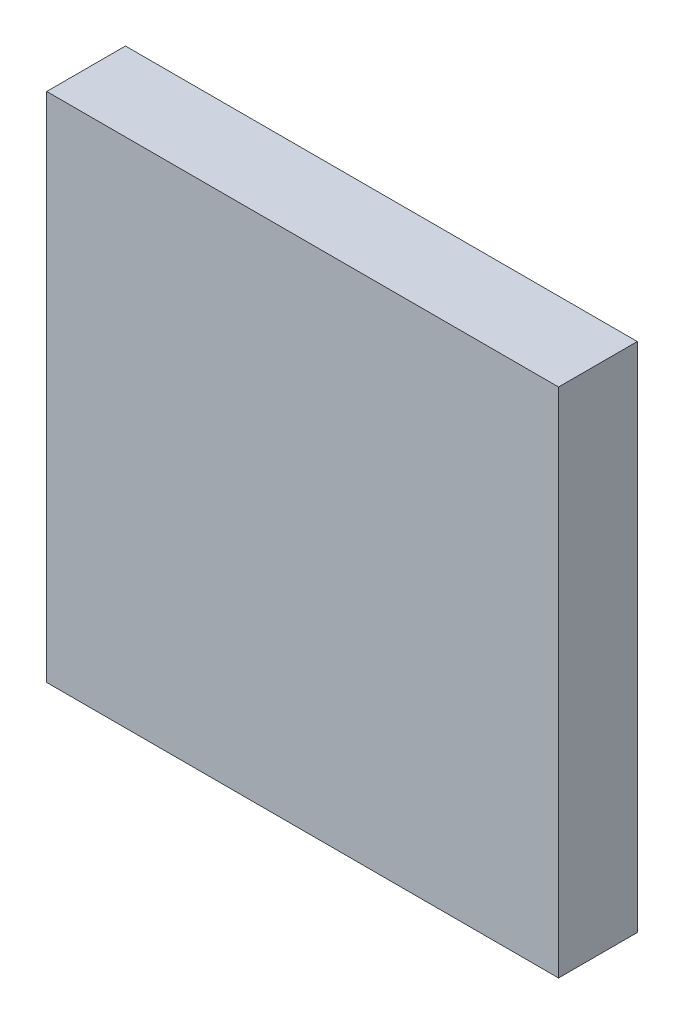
from build123d import *

# Parameters (mm, degrees)
SKETCH1_W      = 13
SKETCH1_H      = 13
EXTRUDE1_DEPTH = 2


with BuildPart() as part:
    # Sketch1 → Extrude1 (new body)
    with BuildSketch(Plane.XY):
        Rectangle(SKETCH1_W, SKETCH1_H)
    extrude(amount=EXTRUDE1_DEPTH)


solid = part.part
